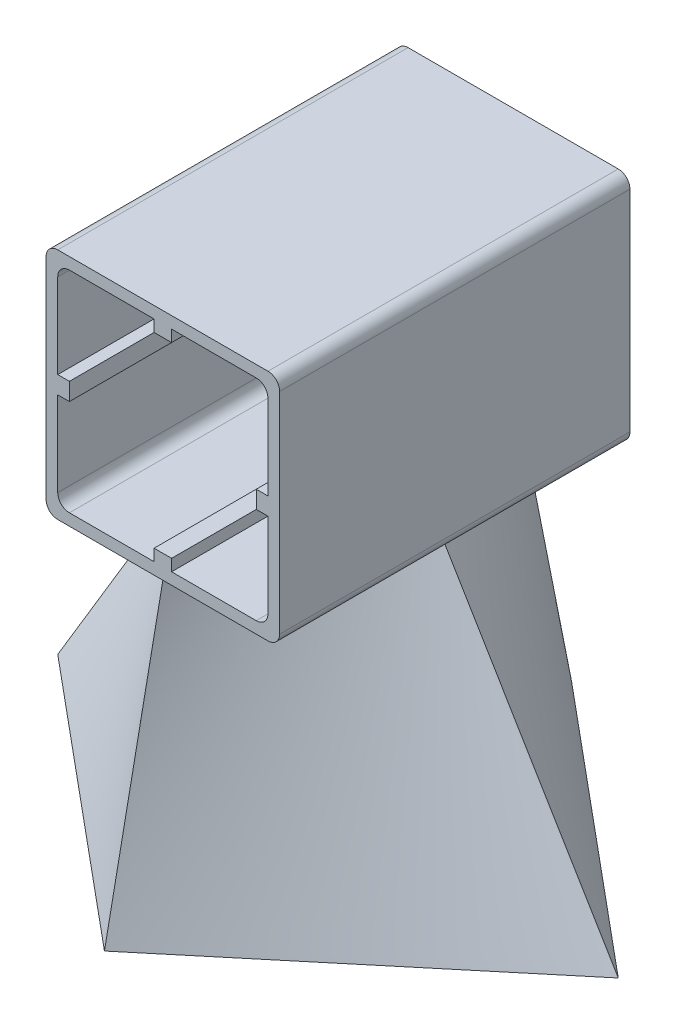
from build123d import *

# Parameters (mm, degrees)
SKETCH_1_W      = 1
SKETCH_1_H      = 1.5
SKETCH_1_W_2    = 1.5
SKETCH_1_H_2    = 1
EXTRUDE_1_DEPTH = 15


with BuildPart() as part:
    # Sketch 1 → Extrude 1 (new, symmetric)
    with BuildSketch(Plane.XY):
        with Locations((8.5, 0)):
            Rectangle(SKETCH_1_W, SKETCH_1_H)
        with Locations((0, 8.5)):
            Rectangle(SKETCH_1_W_2, SKETCH_1_H_2)
        with Locations((-8.5, 0)):
            Rectangle(SKETCH_1_W, SKETCH_1_H)
        with Locations((-9.5, 0)):
            Rectangle(SKETCH_1_W, SKETCH_1_H)
        with Locations((0, -8.5)):
            Rectangle(SKETCH_1_W_2, SKETCH_1_H_2)
        with Locations((0, -9.5)):
            Rectangle(SKETCH_1_W_2, SKETCH_1_H_2)
        with BuildLine():
            Line((10, -0.75), (9, -0.75))
            Line((9, -0.75), (9, -8))
            ThreePointArc((9, -8), (8.707106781, -8.707106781), (8, -9))
            Line((8, -9), (0.75, -9))
            Line((0.75, -9), (0.75, -10))
            Line((0.75, -10), (9, -10))
            ThreePointArc((9, -10), (9.707106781, -9.707106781), (10, -9))
            Line((10, -9), (10, -0.75))
        make_face()
        with Locations((9.5, 0)):
            Rectangle(SKETCH_1_W, SKETCH_1_H)
        with BuildLine():
            Line((9, 8), (9, 0.75))
            Line((9, 0.75), (10, 0.75))
            Line((10, 0.75), (10, 9))
            ThreePointArc((10, 9), (9.707106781, 9.707106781), (9, 10))
            Line((9, 10), (0.75, 10))
            Line((0.75, 10), (0.75, 9))
            Line((0.75, 9), (8, 9))
            ThreePointArc((8, 9), (8.707106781, 8.707106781), (9, 8))
        make_face()
        with BuildLine():
            Line((-8, 9), (-0.75, 9))
            Line((-0.75, 9), (-0.75, 10))
            Line((-0.75, 10), (-9, 10))
            ThreePointArc((-9, 10), (-9.707106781, 9.707106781), (-10, 9))
            Line((-10, 9), (-10, 0.75))
            Line((-10, 0.75), (-9, 0.75))
            Line((-9, 0.75), (-9, 8))
            ThreePointArc((-9, 8), (-8.707106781, 8.707106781), (-8, 9))
        make_face()
        with BuildLine():
            Line((-0.75, -10), (-0.75, -9))
            Line((-0.75, -9), (-8, -9))
            ThreePointArc((-8, -9), (-8.707106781, -8.707106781), (-9, -8))
            Line((-9, -8), (-9, -0.75))
            Line((-9, -0.75), (-10, -0.75))
            Line((-10, -0.75), (-10, -9))
            ThreePointArc((-10, -9), (-9.707106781, -9.707106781), (-9, -10))
            Line((-9, -10), (-0.75, -10))
        make_face()
        with Locations((0, 9.5)):
            Rectangle(SKETCH_1_W_2, SKETCH_1_H_2)
    extrude(amount=EXTRUDE_1_DEPTH, both=True)

    # Sketch 4 → Loft 2 section 0
    with BuildSketch(Plane(origin=(0, -35, 0), x_dir=(-1, 0, 0), z_dir=(0, -1, 0))):
        with BuildLine():
            Line((24, 0), (0, 20))
            Line((0, 20), (-24, 0))
            Line((-24, 0), (0, -20))
            Line((0, -20), (24, 0))
        make_face()
    # Sketch 5 → Loft 2 section 1
    with BuildSketch(Plane.XZ.offset(10)):
        with BuildLine():
            Line((-9, 0), (0, -15))
            Line((0, -15), (9, 0))
            Line((9, 0), (0, 15))
            Line((0, 15), (-9, 0))
        make_face()
    loft()


solid = part.part
